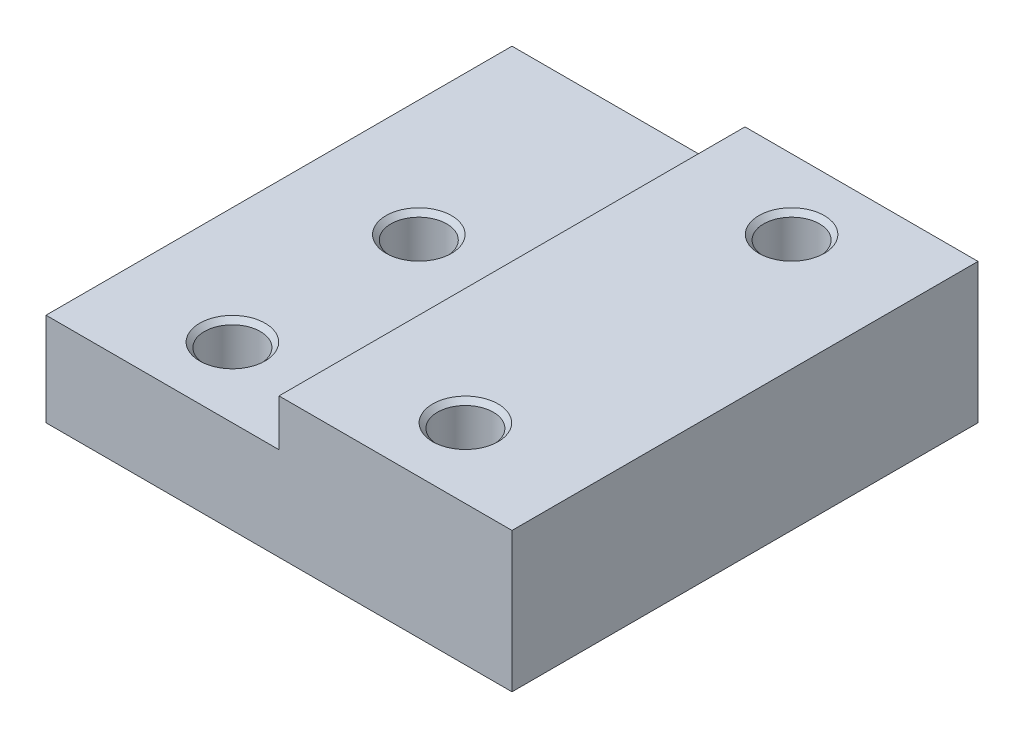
from build123d import *

# Parameters (mm, degrees)
AUFSATZ_LINEAR_AUSTRAGEN1_DEPTH = 100
M14_GEWINDEBOHRUNG1_D           = 12
M14_GEWINDEBOHRUNG1_DEPTH       = 20
M14_GEWINDEBOHRUNG1_CSINK_D     = 14.05
M14_GEWINDEBOHRUNG1_CSINK_ANGLE = 90
M14_GEWINDEBOHRUNG1_TIP         = 3.605163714
M14_GEWINDEBOHRUNG2_D           = 12
M14_GEWINDEBOHRUNG2_CSINK_D     = 14.05
M14_GEWINDEBOHRUNG2_CSINK_ANGLE = 90


with BuildPart() as part:
    # Skizze2 → Aufsatz-Linear austragen1 (new body)
    with BuildSketch(Plane.XY):
        Polygon((0, 0), (100, 0), (100, 30), (50, 30), (50, 20), (0, 20), align=None)
    extrude(amount=AUFSATZ_LINEAR_AUSTRAGEN1_DEPTH)

    # M14 Gewindebohrung1
    with Locations(Plane(origin=(0, 30, 0), x_dir=(-1, 0, 0), z_dir=(0, 1, 0))):
        with Locations((-75, 15), (-75, 85)):
            CounterSinkHole(M14_GEWINDEBOHRUNG1_D / 2, M14_GEWINDEBOHRUNG1_CSINK_D / 2, depth=M14_GEWINDEBOHRUNG1_DEPTH, counter_sink_angle=M14_GEWINDEBOHRUNG1_CSINK_ANGLE)
            with Locations((0, 0, -(M14_GEWINDEBOHRUNG1_DEPTH + M14_GEWINDEBOHRUNG1_TIP / 2))):  # 118° drill point
                Cone(0, M14_GEWINDEBOHRUNG1_D / 2, M14_GEWINDEBOHRUNG1_TIP, mode=Mode.SUBTRACT)

    # M14 Gewindebohrung2 (through all)
    with Locations(Plane(origin=(0, 20, 0), x_dir=(-1, 0, 0), z_dir=(0, 1, 0))):
        with Locations((-25, 85), (-25, 45)):
            CounterSinkHole(M14_GEWINDEBOHRUNG2_D / 2, M14_GEWINDEBOHRUNG2_CSINK_D / 2, counter_sink_angle=M14_GEWINDEBOHRUNG2_CSINK_ANGLE)


solid = part.part
